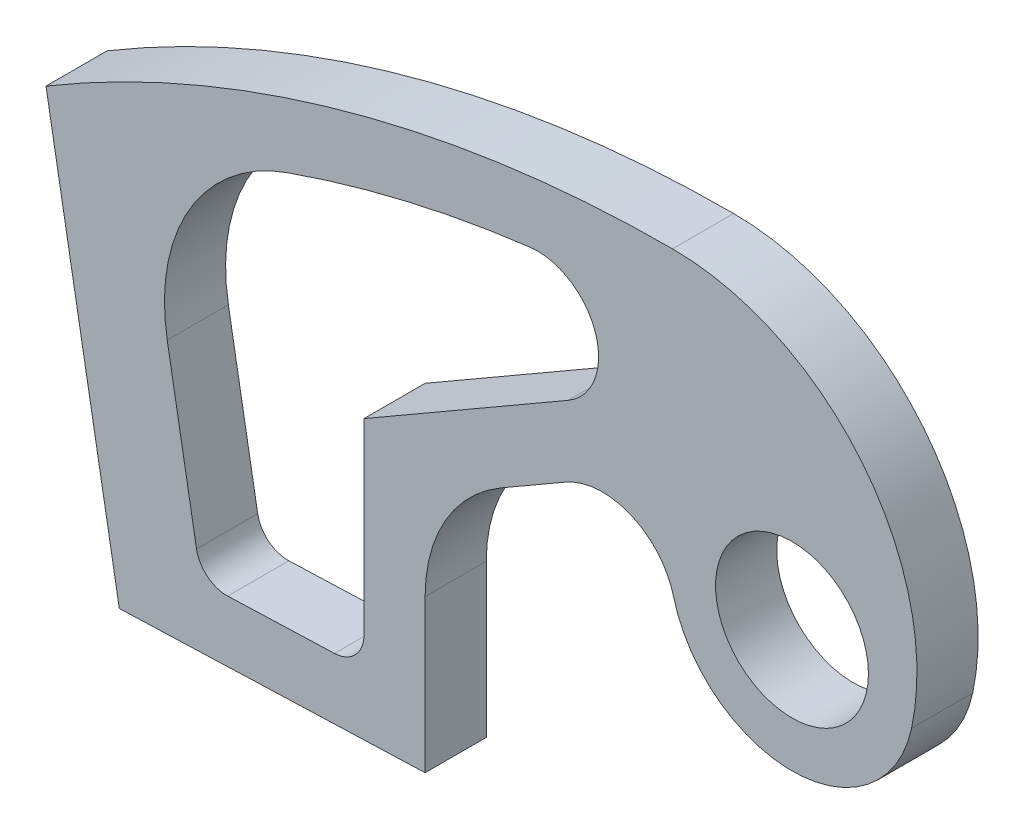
ISO-10303-21;
HEADER;
FILE_DESCRIPTION(('STEP AP214'),'2;1');
FILE_NAME('part.step','',(''),(''),'','','');
FILE_SCHEMA(('AUTOMOTIVE_DESIGN { 1 0 10303 214 1 1 1 1 }'));
ENDSEC;
DATA;
#1=APPLICATION_CONTEXT('core data for automotive mechanical design processes');
#2=APPLICATION_PROTOCOL_DEFINITION('international standard','automotive_design',2000,#1);
#3=PRODUCT_CONTEXT('',#1,'mechanical');
#4=PRODUCT('Part','Part','',(#3));
#5=PRODUCT_RELATED_PRODUCT_CATEGORY('part','',(#4));
#6=PRODUCT_DEFINITION_FORMATION('','',#4);
#7=PRODUCT_DEFINITION_CONTEXT('part definition',#1,'design');
#8=PRODUCT_DEFINITION('design','',#6,#7);
#9=PRODUCT_DEFINITION_SHAPE('','',#8);
#10=(LENGTH_UNIT() NAMED_UNIT(*) SI_UNIT(.MILLI.,.METRE.));
#11=(NAMED_UNIT(*) PLANE_ANGLE_UNIT() SI_UNIT($,.RADIAN.));
#12=(NAMED_UNIT(*) SI_UNIT($,.STERADIAN.) SOLID_ANGLE_UNIT());
#13=UNCERTAINTY_MEASURE_WITH_UNIT(LENGTH_MEASURE(1.E-05),#10,'distance_accuracy_value','');
#14=(GEOMETRIC_REPRESENTATION_CONTEXT(3) GLOBAL_UNCERTAINTY_ASSIGNED_CONTEXT((#13)) GLOBAL_UNIT_ASSIGNED_CONTEXT((#10,
#11,#12)) REPRESENTATION_CONTEXT('',''));
#15=CARTESIAN_POINT('',(0.,0.,0.));
#16=DIRECTION('',(0.,0.,1.));
#17=DIRECTION('',(1.,0.,0.));
#18=AXIS2_PLACEMENT_3D('',#15,#16,#17);
#19=CARTESIAN_POINT('',(75.0097653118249,26.69752971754,10.));
#20=DIRECTION('',(0.,0.,-1.));
#21=DIRECTION('',(-1.,0.,0.));
#22=AXIS2_PLACEMENT_3D('',#19,#20,#21);
#23=PLANE('',#22);
#24=CARTESIAN_POINT('',(110.009765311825,52.,10.));
#25=DIRECTION('',(0.,0.,1.));
#26=DIRECTION('',(1.,0.,0.));
#27=AXIS2_PLACEMENT_3D('',#24,#25,#26);
#28=CIRCLE('',#27,12.5);
#29=CARTESIAN_POINT('',(122.509765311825,52.,10.));
#30=VERTEX_POINT('',#29);
#31=EDGE_CURVE('E524',#30,#30,#28,.T.);
#32=ORIENTED_EDGE('',*,*,#31,.F.);
#33=EDGE_LOOP('',(#32));
#34=FACE_BOUND('',#33,.T.);
#35=DIRECTION('',(0.999390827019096,0.0348994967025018,0.));
#36=VECTOR('',#35,1.);
#37=CARTESIAN_POINT('',(0.,0.,10.));
#38=LINE('',#37,#36);
#39=CARTESIAN_POINT('',(0.,0.,10.));
#40=VERTEX_POINT('',#39);
#41=CARTESIAN_POINT('',(50.0097653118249,1.74637948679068,10.));
#42=VERTEX_POINT('',#41);
#43=EDGE_CURVE('E232',#40,#42,#38,.T.);
#44=ORIENTED_EDGE('',*,*,#43,.T.);
#45=DIRECTION('',(0.,1.,0.));
#46=VECTOR('',#45,1.);
#47=CARTESIAN_POINT('',(50.0097653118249,1.74637948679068,10.));
#48=LINE('',#47,#46);
#49=CARTESIAN_POINT('',(50.0097653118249,26.69752971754,10.));
#50=VERTEX_POINT('',#49);
#51=EDGE_CURVE('E235',#42,#50,#48,.T.);
#52=ORIENTED_EDGE('',*,*,#51,.T.);
#53=CARTESIAN_POINT('',(75.0097653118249,26.69752971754,10.));
#54=DIRECTION('',(0.,0.,-1.));
#55=DIRECTION('',(-1.,0.,0.));
#56=AXIS2_PLACEMENT_3D('',#53,#54,#55);
#57=CIRCLE('',#56,25.);
#58=CARTESIAN_POINT('',(62.509765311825,48.348164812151,10.));
#59=VERTEX_POINT('',#58);
#60=EDGE_CURVE('E238',#50,#59,#57,.T.);
#61=ORIENTED_EDGE('',*,*,#60,.T.);
#62=DIRECTION('',(0.866025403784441,0.499999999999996,0.));
#63=VECTOR('',#62,1.);
#64=CARTESIAN_POINT('',(62.509765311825,48.348164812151,10.));
#65=LINE('',#64,#63);
#66=CARTESIAN_POINT('',(73.0019547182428,54.4058331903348,10.));
#67=VERTEX_POINT('',#66);
#68=EDGE_CURVE('E240',#59,#67,#65,.T.);
#69=ORIENTED_EDGE('',*,*,#68,.T.);
#70=CARTESIAN_POINT('',(79.0097653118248,44.,10.));
#71=DIRECTION('',(0.,0.,-1.));
#72=DIRECTION('',(-1.,0.,0.));
#73=AXIS2_PLACEMENT_3D('',#70,#71,#72);
#74=CIRCLE('',#73,12.0156211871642);
#75=CARTESIAN_POINT('',(90.6442188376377,47.0024396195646,10.));
#76=VERTEX_POINT('',#75);
#77=EDGE_CURVE('E242',#67,#76,#74,.T.);
#78=ORIENTED_EDGE('',*,*,#77,.T.);
#79=CARTESIAN_POINT('',(110.009765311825,52.,10.));
#80=DIRECTION('',(0.,0.,1.));
#81=DIRECTION('',(1.,0.,0.));
#82=AXIS2_PLACEMENT_3D('',#79,#80,#81);
#83=CIRCLE('',#82,20.);
#84=CARTESIAN_POINT('',(129.567947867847,47.819390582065,10.));
#85=VERTEX_POINT('',#84);
#86=EDGE_CURVE('E244',#76,#85,#83,.T.);
#87=ORIENTED_EDGE('',*,*,#86,.T.);
#88=CARTESIAN_POINT('',(90.4515827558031,56.1806094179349,10.));
#89=DIRECTION('',(0.,0.,1.));
#90=DIRECTION('',(1.,0.,0.));
#91=AXIS2_PLACEMENT_3D('',#88,#89,#90);
#92=CIRCLE('',#91,40.0000000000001);
#93=CARTESIAN_POINT('',(90.4713848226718,96.1806045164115,10.));
#94=VERTEX_POINT('',#93);
#95=EDGE_CURVE('E246',#85,#94,#92,.T.);
#96=ORIENTED_EDGE('',*,*,#95,.T.);
#97=CARTESIAN_POINT('',(90.3723744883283,-103.819370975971,10.));
#98=DIRECTION('',(0.,0.,1.));
#99=DIRECTION('',(-1.,0.,0.));
#100=AXIS2_PLACEMENT_3D('',#97,#98,#99);
#101=CIRCLE('',#100,200.);
#102=CARTESIAN_POINT('',(-11.9902346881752,68.,10.));
#103=VERTEX_POINT('',#102);
#104=EDGE_CURVE('E248',#94,#103,#101,.T.);
#105=ORIENTED_EDGE('',*,*,#104,.T.);
#106=DIRECTION('',(0.173648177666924,-0.984807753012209,0.));
#107=VECTOR('',#106,1.);
#108=CARTESIAN_POINT('',(0.,0.,10.));
#109=LINE('',#108,#107);
#110=EDGE_CURVE('E250',#103,#40,#109,.T.);
#111=ORIENTED_EDGE('',*,*,#110,.T.);
#112=EDGE_LOOP('',(#44,#52,#61,#69,#78,#87,#96,#105,#111));
#113=FACE_BOUND('',#112,.T.);
#114=DIRECTION('',(0.866025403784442,0.499999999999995,0.));
#115=VECTOR('',#114,1.);
#116=CARTESIAN_POINT('',(40.0097653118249,46.904789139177,10.));
#117=LINE('',#116,#115);
#118=CARTESIAN_POINT('',(40.0097653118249,46.904789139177,10.));
#119=VERTEX_POINT('',#118);
#120=CARTESIAN_POINT('',(73.3815575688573,66.1720023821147,10.));
#121=VERTEX_POINT('',#120);
#122=EDGE_CURVE('E158',#119,#121,#117,.T.);
#123=ORIENTED_EDGE('',*,*,#122,.F.);
#124=DIRECTION('',(0.,1.,0.));
#125=VECTOR('',#124,1.);
#126=CARTESIAN_POINT('',(40.0097653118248,16.2317111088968,10.));
#127=LINE('',#126,#125);
#128=CARTESIAN_POINT('',(40.0097653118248,16.2317111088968,10.));
#129=VERTEX_POINT('',#128);
#130=EDGE_CURVE('E194',#129,#119,#127,.T.);
#131=ORIENTED_EDGE('',*,*,#130,.F.);
#132=CARTESIAN_POINT('',(35.0097653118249,16.2317111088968,10.));
#133=DIRECTION('',(0.,0.,1.));
#134=DIRECTION('',(1.,0.,0.));
#135=AXIS2_PLACEMENT_3D('',#132,#133,#134);
#136=CIRCLE('',#135,5.);
#137=CARTESIAN_POINT('',(35.1842627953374,11.2347569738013,10.));
#138=VERTEX_POINT('',#137);
#139=EDGE_CURVE('E192',#138,#129,#136,.T.);
#140=ORIENTED_EDGE('',*,*,#139,.F.);
#141=DIRECTION('',(0.999390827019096,0.0348994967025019,0.));
#142=VECTOR('',#141,1.);
#143=CARTESIAN_POINT('',(17.7284249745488,10.6251856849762,10.));
#144=LINE('',#143,#142);
#145=CARTESIAN_POINT('',(17.7284249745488,10.6251856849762,10.));
#146=VERTEX_POINT('',#145);
#147=EDGE_CURVE('E190',#146,#138,#144,.T.);
#148=ORIENTED_EDGE('',*,*,#147,.F.);
#149=CARTESIAN_POINT('',(17.5539274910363,15.6221398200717,10.));
#150=DIRECTION('',(0.,0.,1.));
#151=DIRECTION('',(-1.,0.,0.));
#152=AXIS2_PLACEMENT_3D('',#149,#150,#151);
#153=CIRCLE('',#152,5.);
#154=CARTESIAN_POINT('',(12.6298887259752,14.753898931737,10.));
#155=VERTEX_POINT('',#154);
#156=EDGE_CURVE('E188',#155,#146,#153,.T.);
#157=ORIENTED_EDGE('',*,*,#156,.F.);
#158=DIRECTION('',(0.173648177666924,-0.984807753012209,0.));
#159=VECTOR('',#158,1.);
#160=CARTESIAN_POINT('',(7.83609413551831,41.9408590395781,10.));
#161=LINE('',#160,#159);
#162=CARTESIAN_POINT('',(7.83609413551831,41.9408590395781,10.));
#163=VERTEX_POINT('',#162);
#164=EDGE_CURVE('E186',#163,#155,#161,.T.);
#165=ORIENTED_EDGE('',*,*,#164,.F.);
#166=CARTESIAN_POINT('',(37.3803267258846,47.1503043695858,10.));
#167=DIRECTION('',(0.,0.,1.));
#168=DIRECTION('',(1.,0.,0.));
#169=AXIS2_PLACEMENT_3D('',#166,#167,#168);
#170=CIRCLE('',#169,30.);
#171=CARTESIAN_POINT('',(27.4443177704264,75.4571184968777,10.));
#172=VERTEX_POINT('',#171);
#173=EDGE_CURVE('E181',#172,#163,#170,.T.);
#174=ORIENTED_EDGE('',*,*,#173,.F.);
#175=CARTESIAN_POINT('',(90.3723744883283,-103.819370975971,10.));
#176=DIRECTION('',(0.,0.,1.));
#177=DIRECTION('',(-1.,0.,0.));
#178=AXIS2_PLACEMENT_3D('',#175,#176,#177);
#179=CIRCLE('',#178,190.);
#180=CARTESIAN_POINT('',(67.1598455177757,84.7573468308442,10.));
#181=VERTEX_POINT('',#180);
#182=EDGE_CURVE('E179',#181,#172,#179,.T.);
#183=ORIENTED_EDGE('',*,*,#182,.F.);
#184=CARTESIAN_POINT('',(68.3815575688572,74.832256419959,10.));
#185=DIRECTION('',(0.,0.,1.));
#186=DIRECTION('',(1.,0.,0.));
#187=AXIS2_PLACEMENT_3D('',#184,#185,#186);
#188=CIRCLE('',#187,10.0000000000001);
#189=EDGE_CURVE('E166',#121,#181,#188,.T.);
#190=ORIENTED_EDGE('',*,*,#189,.F.);
#191=EDGE_LOOP('',(#123,#131,#140,#148,#157,#165,#174,#183,#190));
#192=FACE_BOUND('',#191,.T.);
#193=ADVANCED_FACE('F33',(#34,#113,#192),#23,.F.);
#194=CARTESIAN_POINT('',(75.0097653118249,26.69752971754,0.));
#195=DIRECTION('',(0.,0.,-1.));
#196=DIRECTION('',(-1.,0.,0.));
#197=AXIS2_PLACEMENT_3D('',#194,#195,#196);
#198=PLANE('',#197);
#199=CARTESIAN_POINT('',(110.009765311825,52.,0.));
#200=DIRECTION('',(0.,0.,1.));
#201=DIRECTION('',(1.,0.,0.));
#202=AXIS2_PLACEMENT_3D('',#199,#200,#201);
#203=CIRCLE('',#202,12.5);
#204=CARTESIAN_POINT('',(122.509765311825,52.,0.));
#205=VERTEX_POINT('',#204);
#206=EDGE_CURVE('E197',#205,#205,#203,.T.);
#207=ORIENTED_EDGE('',*,*,#206,.T.);
#208=EDGE_LOOP('',(#207));
#209=FACE_BOUND('',#208,.T.);
#210=DIRECTION('',(0.999390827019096,0.0348994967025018,0.));
#211=VECTOR('',#210,1.);
#212=CARTESIAN_POINT('',(0.,0.,0.));
#213=LINE('',#212,#211);
#214=CARTESIAN_POINT('',(0.,0.,0.));
#215=VERTEX_POINT('',#214);
#216=CARTESIAN_POINT('',(50.0097653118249,1.74637948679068,0.));
#217=VERTEX_POINT('',#216);
#218=EDGE_CURVE('E174',#215,#217,#213,.T.);
#219=ORIENTED_EDGE('',*,*,#218,.F.);
#220=DIRECTION('',(0.173648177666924,-0.984807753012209,0.));
#221=VECTOR('',#220,1.);
#222=CARTESIAN_POINT('',(0.,0.,0.));
#223=LINE('',#222,#221);
#224=CARTESIAN_POINT('',(-11.9902346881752,68.,0.));
#225=VERTEX_POINT('',#224);
#226=EDGE_CURVE('E236',#225,#215,#223,.T.);
#227=ORIENTED_EDGE('',*,*,#226,.F.);
#228=CARTESIAN_POINT('',(90.3723744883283,-103.819370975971,0.));
#229=DIRECTION('',(0.,0.,1.));
#230=DIRECTION('',(-1.,0.,0.));
#231=AXIS2_PLACEMENT_3D('',#228,#229,#230);
#232=CIRCLE('',#231,200.);
#233=CARTESIAN_POINT('',(90.4713848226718,96.1806045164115,0.));
#234=VERTEX_POINT('',#233);
#235=EDGE_CURVE('E267',#234,#225,#232,.T.);
#236=ORIENTED_EDGE('',*,*,#235,.F.);
#237=CARTESIAN_POINT('',(90.4515827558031,56.1806094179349,0.));
#238=DIRECTION('',(0.,0.,1.));
#239=DIRECTION('',(1.,0.,0.));
#240=AXIS2_PLACEMENT_3D('',#237,#238,#239);
#241=CIRCLE('',#240,40.0000000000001);
#242=CARTESIAN_POINT('',(129.567947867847,47.819390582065,0.));
#243=VERTEX_POINT('',#242);
#244=EDGE_CURVE('E265',#243,#234,#241,.T.);
#245=ORIENTED_EDGE('',*,*,#244,.F.);
#246=CARTESIAN_POINT('',(110.009765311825,52.,0.));
#247=DIRECTION('',(0.,0.,1.));
#248=DIRECTION('',(1.,0.,0.));
#249=AXIS2_PLACEMENT_3D('',#246,#247,#248);
#250=CIRCLE('',#249,20.);
#251=CARTESIAN_POINT('',(90.6442188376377,47.0024396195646,0.));
#252=VERTEX_POINT('',#251);
#253=EDGE_CURVE('E263',#252,#243,#250,.T.);
#254=ORIENTED_EDGE('',*,*,#253,.F.);
#255=CARTESIAN_POINT('',(79.0097653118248,44.,0.));
#256=DIRECTION('',(0.,0.,-1.));
#257=DIRECTION('',(-1.,0.,0.));
#258=AXIS2_PLACEMENT_3D('',#255,#256,#257);
#259=CIRCLE('',#258,12.0156211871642);
#260=CARTESIAN_POINT('',(73.0019547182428,54.4058331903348,0.));
#261=VERTEX_POINT('',#260);
#262=EDGE_CURVE('E261',#261,#252,#259,.T.);
#263=ORIENTED_EDGE('',*,*,#262,.F.);
#264=DIRECTION('',(0.866025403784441,0.499999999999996,0.));
#265=VECTOR('',#264,1.);
#266=CARTESIAN_POINT('',(62.509765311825,48.348164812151,0.));
#267=LINE('',#266,#265);
#268=CARTESIAN_POINT('',(62.509765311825,48.348164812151,0.));
#269=VERTEX_POINT('',#268);
#270=EDGE_CURVE('E259',#269,#261,#267,.T.);
#271=ORIENTED_EDGE('',*,*,#270,.F.);
#272=CARTESIAN_POINT('',(75.0097653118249,26.69752971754,0.));
#273=DIRECTION('',(0.,0.,-1.));
#274=DIRECTION('',(-1.,0.,0.));
#275=AXIS2_PLACEMENT_3D('',#272,#273,#274);
#276=CIRCLE('',#275,25.);
#277=CARTESIAN_POINT('',(50.0097653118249,26.69752971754,0.));
#278=VERTEX_POINT('',#277);
#279=EDGE_CURVE('E257',#278,#269,#276,.T.);
#280=ORIENTED_EDGE('',*,*,#279,.F.);
#281=DIRECTION('',(0.,1.,0.));
#282=VECTOR('',#281,1.);
#283=CARTESIAN_POINT('',(50.0097653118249,1.74637948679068,0.));
#284=LINE('',#283,#282);
#285=EDGE_CURVE('E255',#217,#278,#284,.T.);
#286=ORIENTED_EDGE('',*,*,#285,.F.);
#287=EDGE_LOOP('',(#219,#227,#236,#245,#254,#263,#271,#280,#286));
#288=FACE_BOUND('',#287,.T.);
#289=DIRECTION('',(0.,1.,0.));
#290=VECTOR('',#289,1.);
#291=CARTESIAN_POINT('',(40.0097653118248,16.2317111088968,0.));
#292=LINE('',#291,#290);
#293=CARTESIAN_POINT('',(40.0097653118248,16.2317111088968,0.));
#294=VERTEX_POINT('',#293);
#295=CARTESIAN_POINT('',(40.0097653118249,46.904789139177,0.));
#296=VERTEX_POINT('',#295);
#297=EDGE_CURVE('E167',#294,#296,#292,.T.);
#298=ORIENTED_EDGE('',*,*,#297,.T.);
#299=DIRECTION('',(0.866025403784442,0.499999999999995,0.));
#300=VECTOR('',#299,1.);
#301=CARTESIAN_POINT('',(40.0097653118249,46.904789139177,0.));
#302=LINE('',#301,#300);
#303=CARTESIAN_POINT('',(73.3815575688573,66.1720023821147,0.));
#304=VERTEX_POINT('',#303);
#305=EDGE_CURVE('E56',#296,#304,#302,.T.);
#306=ORIENTED_EDGE('',*,*,#305,.T.);
#307=CARTESIAN_POINT('',(68.3815575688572,74.832256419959,0.));
#308=DIRECTION('',(0.,0.,1.));
#309=DIRECTION('',(1.,0.,0.));
#310=AXIS2_PLACEMENT_3D('',#307,#308,#309);
#311=CIRCLE('',#310,10.0000000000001);
#312=CARTESIAN_POINT('',(67.1598455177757,84.7573468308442,0.));
#313=VERTEX_POINT('',#312);
#314=EDGE_CURVE('E173',#304,#313,#311,.T.);
#315=ORIENTED_EDGE('',*,*,#314,.T.);
#316=CARTESIAN_POINT('',(90.3723744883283,-103.819370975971,0.));
#317=DIRECTION('',(0.,0.,1.));
#318=DIRECTION('',(-1.,0.,0.));
#319=AXIS2_PLACEMENT_3D('',#316,#317,#318);
#320=CIRCLE('',#319,190.);
#321=CARTESIAN_POINT('',(27.4443177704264,75.4571184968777,0.));
#322=VERTEX_POINT('',#321);
#323=EDGE_CURVE('E199',#313,#322,#320,.T.);
#324=ORIENTED_EDGE('',*,*,#323,.T.);
#325=CARTESIAN_POINT('',(37.3803267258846,47.1503043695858,0.));
#326=DIRECTION('',(0.,0.,1.));
#327=DIRECTION('',(1.,0.,0.));
#328=AXIS2_PLACEMENT_3D('',#325,#326,#327);
#329=CIRCLE('',#328,30.);
#330=CARTESIAN_POINT('',(7.83609413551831,41.9408590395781,0.));
#331=VERTEX_POINT('',#330);
#332=EDGE_CURVE('E202',#322,#331,#329,.T.);
#333=ORIENTED_EDGE('',*,*,#332,.T.);
#334=DIRECTION('',(0.173648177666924,-0.984807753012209,0.));
#335=VECTOR('',#334,1.);
#336=CARTESIAN_POINT('',(7.83609413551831,41.9408590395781,0.));
#337=LINE('',#336,#335);
#338=CARTESIAN_POINT('',(12.6298887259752,14.753898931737,0.));
#339=VERTEX_POINT('',#338);
#340=EDGE_CURVE('E205',#331,#339,#337,.T.);
#341=ORIENTED_EDGE('',*,*,#340,.T.);
#342=CARTESIAN_POINT('',(17.5539274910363,15.6221398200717,0.));
#343=DIRECTION('',(0.,0.,1.));
#344=DIRECTION('',(-1.,0.,0.));
#345=AXIS2_PLACEMENT_3D('',#342,#343,#344);
#346=CIRCLE('',#345,5.);
#347=CARTESIAN_POINT('',(17.7284249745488,10.6251856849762,0.));
#348=VERTEX_POINT('',#347);
#349=EDGE_CURVE('E208',#339,#348,#346,.T.);
#350=ORIENTED_EDGE('',*,*,#349,.T.);
#351=DIRECTION('',(0.999390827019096,0.0348994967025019,0.));
#352=VECTOR('',#351,1.);
#353=CARTESIAN_POINT('',(17.7284249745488,10.6251856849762,0.));
#354=LINE('',#353,#352);
#355=CARTESIAN_POINT('',(35.1842627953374,11.2347569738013,0.));
#356=VERTEX_POINT('',#355);
#357=EDGE_CURVE('E211',#348,#356,#354,.T.);
#358=ORIENTED_EDGE('',*,*,#357,.T.);
#359=CARTESIAN_POINT('',(35.0097653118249,16.2317111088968,0.));
#360=DIRECTION('',(0.,0.,1.));
#361=DIRECTION('',(1.,0.,0.));
#362=AXIS2_PLACEMENT_3D('',#359,#360,#361);
#363=CIRCLE('',#362,5.);
#364=EDGE_CURVE('E214',#356,#294,#363,.T.);
#365=ORIENTED_EDGE('',*,*,#364,.T.);
#366=EDGE_LOOP('',(#298,#306,#315,#324,#333,#341,#350,#358,#365));
#367=FACE_BOUND('',#366,.T.);
#368=ADVANCED_FACE('F300',(#209,#288,#367),#198,.T.);
#369=CARTESIAN_POINT('',(0.,0.,10.));
#370=DIRECTION('',(-0.0348994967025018,0.999390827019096,0.));
#371=DIRECTION('',(-0.999390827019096,-0.0348994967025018,0.));
#372=AXIS2_PLACEMENT_3D('',#369,#370,#371);
#373=PLANE('',#372);
#374=ORIENTED_EDGE('',*,*,#218,.T.);
#375=DIRECTION('',(0.,0.,-1.));
#376=VECTOR('',#375,1.);
#377=CARTESIAN_POINT('',(50.0097653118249,1.74637948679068,10.));
#378=LINE('',#377,#376);
#379=EDGE_CURVE('E11',#42,#217,#378,.T.);
#380=ORIENTED_EDGE('',*,*,#379,.F.);
#381=ORIENTED_EDGE('',*,*,#43,.F.);
#382=DIRECTION('',(0.,0.,-1.));
#383=VECTOR('',#382,1.);
#384=CARTESIAN_POINT('',(0.,0.,10.));
#385=LINE('',#384,#383);
#386=EDGE_CURVE('E252',#40,#215,#385,.T.);
#387=ORIENTED_EDGE('',*,*,#386,.T.);
#388=EDGE_LOOP('',(#374,#380,#381,#387));
#389=FACE_BOUND('',#388,.T.);
#390=ADVANCED_FACE('F35',(#389),#373,.F.);
#391=CARTESIAN_POINT('',(50.0097653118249,1.74637948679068,10.));
#392=DIRECTION('',(-1.,0.,0.));
#393=DIRECTION('',(0.,-1.,0.));
#394=AXIS2_PLACEMENT_3D('',#391,#392,#393);
#395=PLANE('',#394);
#396=ORIENTED_EDGE('',*,*,#285,.T.);
#397=DIRECTION('',(0.,0.,-1.));
#398=VECTOR('',#397,1.);
#399=CARTESIAN_POINT('',(50.0097653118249,26.69752971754,10.));
#400=LINE('',#399,#398);
#401=EDGE_CURVE('E41',#50,#278,#400,.T.);
#402=ORIENTED_EDGE('',*,*,#401,.F.);
#403=ORIENTED_EDGE('',*,*,#51,.F.);
#404=ORIENTED_EDGE('',*,*,#379,.T.);
#405=EDGE_LOOP('',(#396,#402,#403,#404));
#406=FACE_BOUND('',#405,.T.);
#407=ADVANCED_FACE('F317',(#406),#395,.F.);
#408=CARTESIAN_POINT('',(75.0097653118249,26.69752971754,10.));
#409=DIRECTION('',(0.,0.,-1.));
#410=DIRECTION('',(-1.,0.,0.));
#411=AXIS2_PLACEMENT_3D('',#408,#409,#410);
#412=CYLINDRICAL_SURFACE('',#411,25.);
#413=ORIENTED_EDGE('',*,*,#279,.T.);
#414=DIRECTION('',(0.,0.,-1.));
#415=VECTOR('',#414,1.);
#416=CARTESIAN_POINT('',(62.509765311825,48.348164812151,10.));
#417=LINE('',#416,#415);
#418=EDGE_CURVE('E287',#59,#269,#417,.T.);
#419=ORIENTED_EDGE('',*,*,#418,.F.);
#420=ORIENTED_EDGE('',*,*,#60,.F.);
#421=ORIENTED_EDGE('',*,*,#401,.T.);
#422=EDGE_LOOP('',(#413,#419,#420,#421));
#423=FACE_BOUND('',#422,.T.);
#424=ADVANCED_FACE('F294',(#423),#412,.F.);
#425=CARTESIAN_POINT('',(62.509765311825,48.348164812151,10.));
#426=DIRECTION('',(-0.499999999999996,0.866025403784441,0.));
#427=DIRECTION('',(-0.866025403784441,-0.499999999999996,0.));
#428=AXIS2_PLACEMENT_3D('',#425,#426,#427);
#429=PLANE('',#428);
#430=ORIENTED_EDGE('',*,*,#270,.T.);
#431=DIRECTION('',(0.,0.,-1.));
#432=VECTOR('',#431,1.);
#433=CARTESIAN_POINT('',(73.0019547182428,54.4058331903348,10.));
#434=LINE('',#433,#432);
#435=EDGE_CURVE('E284',#67,#261,#434,.T.);
#436=ORIENTED_EDGE('',*,*,#435,.F.);
#437=ORIENTED_EDGE('',*,*,#68,.F.);
#438=ORIENTED_EDGE('',*,*,#418,.T.);
#439=EDGE_LOOP('',(#430,#436,#437,#438));
#440=FACE_BOUND('',#439,.T.);
#441=ADVANCED_FACE('F306',(#440),#429,.F.);
#442=CARTESIAN_POINT('',(79.0097653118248,44.,10.));
#443=DIRECTION('',(0.,0.,-1.));
#444=DIRECTION('',(-1.,0.,0.));
#445=AXIS2_PLACEMENT_3D('',#442,#443,#444);
#446=CYLINDRICAL_SURFACE('',#445,12.0156211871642);
#447=ORIENTED_EDGE('',*,*,#262,.T.);
#448=DIRECTION('',(0.,0.,-1.));
#449=VECTOR('',#448,1.);
#450=CARTESIAN_POINT('',(90.6442188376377,47.0024396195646,10.));
#451=LINE('',#450,#449);
#452=EDGE_CURVE('E281',#76,#252,#451,.T.);
#453=ORIENTED_EDGE('',*,*,#452,.F.);
#454=ORIENTED_EDGE('',*,*,#77,.F.);
#455=ORIENTED_EDGE('',*,*,#435,.T.);
#456=EDGE_LOOP('',(#447,#453,#454,#455));
#457=FACE_BOUND('',#456,.T.);
#458=ADVANCED_FACE('F310',(#457),#446,.F.);
#459=CARTESIAN_POINT('',(110.009765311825,52.,10.));
#460=DIRECTION('',(0.,0.,-1.));
#461=DIRECTION('',(-1.,0.,0.));
#462=AXIS2_PLACEMENT_3D('',#459,#460,#461);
#463=CYLINDRICAL_SURFACE('',#462,20.);
#464=ORIENTED_EDGE('',*,*,#253,.T.);
#465=DIRECTION('',(0.,0.,-1.));
#466=VECTOR('',#465,1.);
#467=CARTESIAN_POINT('',(129.567947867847,47.819390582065,10.));
#468=LINE('',#467,#466);
#469=EDGE_CURVE('E278',#85,#243,#468,.T.);
#470=ORIENTED_EDGE('',*,*,#469,.F.);
#471=ORIENTED_EDGE('',*,*,#86,.F.);
#472=ORIENTED_EDGE('',*,*,#452,.T.);
#473=EDGE_LOOP('',(#464,#470,#471,#472));
#474=FACE_BOUND('',#473,.T.);
#475=ADVANCED_FACE('F335',(#474),#463,.T.);
#476=CARTESIAN_POINT('',(90.4515827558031,56.1806094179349,10.));
#477=DIRECTION('',(0.,0.,-1.));
#478=DIRECTION('',(-1.,0.,0.));
#479=AXIS2_PLACEMENT_3D('',#476,#477,#478);
#480=CYLINDRICAL_SURFACE('',#479,40.0000000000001);
#481=ORIENTED_EDGE('',*,*,#244,.T.);
#482=DIRECTION('',(0.,0.,-1.));
#483=VECTOR('',#482,1.);
#484=CARTESIAN_POINT('',(90.4713848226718,96.1806045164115,10.));
#485=LINE('',#484,#483);
#486=EDGE_CURVE('E275',#94,#234,#485,.T.);
#487=ORIENTED_EDGE('',*,*,#486,.F.);
#488=ORIENTED_EDGE('',*,*,#95,.F.);
#489=ORIENTED_EDGE('',*,*,#469,.T.);
#490=EDGE_LOOP('',(#481,#487,#488,#489));
#491=FACE_BOUND('',#490,.T.);
#492=ADVANCED_FACE('F333',(#491),#480,.T.);
#493=CARTESIAN_POINT('',(90.3723744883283,-103.819370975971,10.));
#494=DIRECTION('',(0.,0.,-1.));
#495=DIRECTION('',(-1.,0.,0.));
#496=AXIS2_PLACEMENT_3D('',#493,#494,#495);
#497=CYLINDRICAL_SURFACE('',#496,200.);
#498=ORIENTED_EDGE('',*,*,#235,.T.);
#499=DIRECTION('',(0.,0.,-1.));
#500=VECTOR('',#499,1.);
#501=CARTESIAN_POINT('',(-11.9902346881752,68.,10.));
#502=LINE('',#501,#500);
#503=EDGE_CURVE('E272',#103,#225,#502,.T.);
#504=ORIENTED_EDGE('',*,*,#503,.F.);
#505=ORIENTED_EDGE('',*,*,#104,.F.);
#506=ORIENTED_EDGE('',*,*,#486,.T.);
#507=EDGE_LOOP('',(#498,#504,#505,#506));
#508=FACE_BOUND('',#507,.T.);
#509=ADVANCED_FACE('F329',(#508),#497,.T.);
#510=CARTESIAN_POINT('',(0.,0.,10.));
#511=DIRECTION('',(0.984807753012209,0.173648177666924,0.));
#512=DIRECTION('',(-0.173648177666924,0.984807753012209,0.));
#513=AXIS2_PLACEMENT_3D('',#510,#511,#512);
#514=PLANE('',#513);
#515=ORIENTED_EDGE('',*,*,#226,.T.);
#516=ORIENTED_EDGE('',*,*,#386,.F.);
#517=ORIENTED_EDGE('',*,*,#110,.F.);
#518=ORIENTED_EDGE('',*,*,#503,.T.);
#519=EDGE_LOOP('',(#515,#516,#517,#518));
#520=FACE_BOUND('',#519,.T.);
#521=ADVANCED_FACE('F324',(#520),#514,.F.);
#522=CARTESIAN_POINT('',(40.0097653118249,46.904789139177,10.));
#523=DIRECTION('',(-0.499999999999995,0.866025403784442,0.));
#524=DIRECTION('',(-0.866025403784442,-0.499999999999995,0.));
#525=AXIS2_PLACEMENT_3D('',#522,#523,#524);
#526=PLANE('',#525);
#527=ORIENTED_EDGE('',*,*,#305,.F.);
#528=DIRECTION('',(0.,0.,-1.));
#529=VECTOR('',#528,1.);
#530=CARTESIAN_POINT('',(40.0097653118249,46.904789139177,10.));
#531=LINE('',#530,#529);
#532=EDGE_CURVE('E162',#119,#296,#531,.T.);
#533=ORIENTED_EDGE('',*,*,#532,.F.);
#534=ORIENTED_EDGE('',*,*,#122,.T.);
#535=DIRECTION('',(0.,0.,-1.));
#536=VECTOR('',#535,1.);
#537=CARTESIAN_POINT('',(73.3815575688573,66.1720023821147,10.));
#538=LINE('',#537,#536);
#539=EDGE_CURVE('E161',#121,#304,#538,.T.);
#540=ORIENTED_EDGE('',*,*,#539,.T.);
#541=EDGE_LOOP('',(#527,#533,#534,#540));
#542=FACE_BOUND('',#541,.T.);
#543=ADVANCED_FACE('F160',(#542),#526,.T.);
#544=CARTESIAN_POINT('',(68.3815575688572,74.832256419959,10.));
#545=DIRECTION('',(0.,0.,-1.));
#546=DIRECTION('',(-1.,0.,0.));
#547=AXIS2_PLACEMENT_3D('',#544,#545,#546);
#548=CYLINDRICAL_SURFACE('',#547,10.0000000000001);
#549=ORIENTED_EDGE('',*,*,#314,.F.);
#550=ORIENTED_EDGE('',*,*,#539,.F.);
#551=ORIENTED_EDGE('',*,*,#189,.T.);
#552=DIRECTION('',(0.,0.,-1.));
#553=VECTOR('',#552,1.);
#554=CARTESIAN_POINT('',(67.1598455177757,84.7573468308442,10.));
#555=LINE('',#554,#553);
#556=EDGE_CURVE('E175',#181,#313,#555,.T.);
#557=ORIENTED_EDGE('',*,*,#556,.T.);
#558=EDGE_LOOP('',(#549,#550,#551,#557));
#559=FACE_BOUND('',#558,.T.);
#560=ADVANCED_FACE('F170',(#559),#548,.F.);
#561=CARTESIAN_POINT('',(90.3723744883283,-103.819370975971,10.));
#562=DIRECTION('',(0.,0.,-1.));
#563=DIRECTION('',(-1.,0.,0.));
#564=AXIS2_PLACEMENT_3D('',#561,#562,#563);
#565=CYLINDRICAL_SURFACE('',#564,190.);
#566=ORIENTED_EDGE('',*,*,#323,.F.);
#567=ORIENTED_EDGE('',*,*,#556,.F.);
#568=ORIENTED_EDGE('',*,*,#182,.T.);
#569=DIRECTION('',(0.,0.,-1.));
#570=VECTOR('',#569,1.);
#571=CARTESIAN_POINT('',(27.4443177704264,75.4571184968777,10.));
#572=LINE('',#571,#570);
#573=EDGE_CURVE('E229',#172,#322,#572,.T.);
#574=ORIENTED_EDGE('',*,*,#573,.T.);
#575=EDGE_LOOP('',(#566,#567,#568,#574));
#576=FACE_BOUND('',#575,.T.);
#577=ADVANCED_FACE('F378',(#576),#565,.F.);
#578=CARTESIAN_POINT('',(37.3803267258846,47.1503043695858,10.));
#579=DIRECTION('',(0.,0.,-1.));
#580=DIRECTION('',(-1.,0.,0.));
#581=AXIS2_PLACEMENT_3D('',#578,#579,#580);
#582=CYLINDRICAL_SURFACE('',#581,30.);
#583=ORIENTED_EDGE('',*,*,#332,.F.);
#584=ORIENTED_EDGE('',*,*,#573,.F.);
#585=ORIENTED_EDGE('',*,*,#173,.T.);
#586=DIRECTION('',(0.,0.,-1.));
#587=VECTOR('',#586,1.);
#588=CARTESIAN_POINT('',(7.83609413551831,41.9408590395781,10.));
#589=LINE('',#588,#587);
#590=EDGE_CURVE('E227',#163,#331,#589,.T.);
#591=ORIENTED_EDGE('',*,*,#590,.T.);
#592=EDGE_LOOP('',(#583,#584,#585,#591));
#593=FACE_BOUND('',#592,.T.);
#594=ADVANCED_FACE('F384',(#593),#582,.F.);
#595=CARTESIAN_POINT('',(7.83609413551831,41.9408590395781,10.));
#596=DIRECTION('',(0.984807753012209,0.173648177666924,0.));
#597=DIRECTION('',(-0.173648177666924,0.984807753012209,0.));
#598=AXIS2_PLACEMENT_3D('',#595,#596,#597);
#599=PLANE('',#598);
#600=ORIENTED_EDGE('',*,*,#340,.F.);
#601=ORIENTED_EDGE('',*,*,#590,.F.);
#602=ORIENTED_EDGE('',*,*,#164,.T.);
#603=DIRECTION('',(0.,0.,-1.));
#604=VECTOR('',#603,1.);
#605=CARTESIAN_POINT('',(12.6298887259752,14.753898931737,10.));
#606=LINE('',#605,#604);
#607=EDGE_CURVE('E225',#155,#339,#606,.T.);
#608=ORIENTED_EDGE('',*,*,#607,.T.);
#609=EDGE_LOOP('',(#600,#601,#602,#608));
#610=FACE_BOUND('',#609,.T.);
#611=ADVANCED_FACE('F392',(#610),#599,.T.);
#612=CARTESIAN_POINT('',(17.5539274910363,15.6221398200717,10.));
#613=DIRECTION('',(0.,0.,-1.));
#614=DIRECTION('',(-1.,0.,0.));
#615=AXIS2_PLACEMENT_3D('',#612,#613,#614);
#616=CYLINDRICAL_SURFACE('',#615,5.);
#617=ORIENTED_EDGE('',*,*,#349,.F.);
#618=ORIENTED_EDGE('',*,*,#607,.F.);
#619=ORIENTED_EDGE('',*,*,#156,.T.);
#620=DIRECTION('',(0.,0.,-1.));
#621=VECTOR('',#620,1.);
#622=CARTESIAN_POINT('',(17.7284249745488,10.6251856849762,10.));
#623=LINE('',#622,#621);
#624=EDGE_CURVE('E223',#146,#348,#623,.T.);
#625=ORIENTED_EDGE('',*,*,#624,.T.);
#626=EDGE_LOOP('',(#617,#618,#619,#625));
#627=FACE_BOUND('',#626,.T.);
#628=ADVANCED_FACE('F400',(#627),#616,.F.);
#629=CARTESIAN_POINT('',(17.7284249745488,10.6251856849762,10.));
#630=DIRECTION('',(-0.0348994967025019,0.999390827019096,0.));
#631=DIRECTION('',(-0.999390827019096,-0.0348994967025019,0.));
#632=AXIS2_PLACEMENT_3D('',#629,#630,#631);
#633=PLANE('',#632);
#634=ORIENTED_EDGE('',*,*,#357,.F.);
#635=ORIENTED_EDGE('',*,*,#624,.F.);
#636=ORIENTED_EDGE('',*,*,#147,.T.);
#637=DIRECTION('',(0.,0.,-1.));
#638=VECTOR('',#637,1.);
#639=CARTESIAN_POINT('',(35.1842627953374,11.2347569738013,10.));
#640=LINE('',#639,#638);
#641=EDGE_CURVE('E221',#138,#356,#640,.T.);
#642=ORIENTED_EDGE('',*,*,#641,.T.);
#643=EDGE_LOOP('',(#634,#635,#636,#642));
#644=FACE_BOUND('',#643,.T.);
#645=ADVANCED_FACE('F408',(#644),#633,.T.);
#646=CARTESIAN_POINT('',(35.0097653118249,16.2317111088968,10.));
#647=DIRECTION('',(0.,0.,-1.));
#648=DIRECTION('',(-1.,0.,0.));
#649=AXIS2_PLACEMENT_3D('',#646,#647,#648);
#650=CYLINDRICAL_SURFACE('',#649,5.);
#651=ORIENTED_EDGE('',*,*,#364,.F.);
#652=ORIENTED_EDGE('',*,*,#641,.F.);
#653=ORIENTED_EDGE('',*,*,#139,.T.);
#654=DIRECTION('',(0.,0.,-1.));
#655=VECTOR('',#654,1.);
#656=CARTESIAN_POINT('',(40.0097653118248,16.2317111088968,10.));
#657=LINE('',#656,#655);
#658=EDGE_CURVE('E48',#129,#294,#657,.T.);
#659=ORIENTED_EDGE('',*,*,#658,.T.);
#660=EDGE_LOOP('',(#651,#652,#653,#659));
#661=FACE_BOUND('',#660,.T.);
#662=ADVANCED_FACE('F416',(#661),#650,.F.);
#663=CARTESIAN_POINT('',(40.0097653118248,16.2317111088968,10.));
#664=DIRECTION('',(-1.,0.,0.));
#665=DIRECTION('',(0.,-1.,0.));
#666=AXIS2_PLACEMENT_3D('',#663,#664,#665);
#667=PLANE('',#666);
#668=ORIENTED_EDGE('',*,*,#297,.F.);
#669=ORIENTED_EDGE('',*,*,#658,.F.);
#670=ORIENTED_EDGE('',*,*,#130,.T.);
#671=ORIENTED_EDGE('',*,*,#532,.T.);
#672=EDGE_LOOP('',(#668,#669,#670,#671));
#673=FACE_BOUND('',#672,.T.);
#674=ADVANCED_FACE('F424',(#673),#667,.T.);
#675=CARTESIAN_POINT('',(110.009765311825,52.,0.));
#676=DIRECTION('',(0.,0.,1.));
#677=DIRECTION('',(1.,0.,0.));
#678=AXIS2_PLACEMENT_3D('',#675,#676,#677);
#679=CYLINDRICAL_SURFACE('',#678,12.5);
#680=ORIENTED_EDGE('',*,*,#206,.F.);
#681=EDGE_LOOP('',(#680));
#682=FACE_BOUND('',#681,.T.);
#683=ORIENTED_EDGE('',*,*,#31,.T.);
#684=EDGE_LOOP('',(#683));
#685=FACE_BOUND('',#684,.T.);
#686=ADVANCED_FACE('F432',(#682,#685),#679,.F.);
#687=CLOSED_SHELL('',(#193,#368,#390,#407,#424,#441,#458,#475,#492,#509,#521,#543,#560,#577,
#594,#611,#628,#645,#662,#674,#686));
#688=MANIFOLD_SOLID_BREP('B2',#687);
#689=ADVANCED_BREP_SHAPE_REPRESENTATION('',(#18,#688),#14);
#690=SHAPE_DEFINITION_REPRESENTATION(#9,#689);
ENDSEC;
END-ISO-10303-21;
